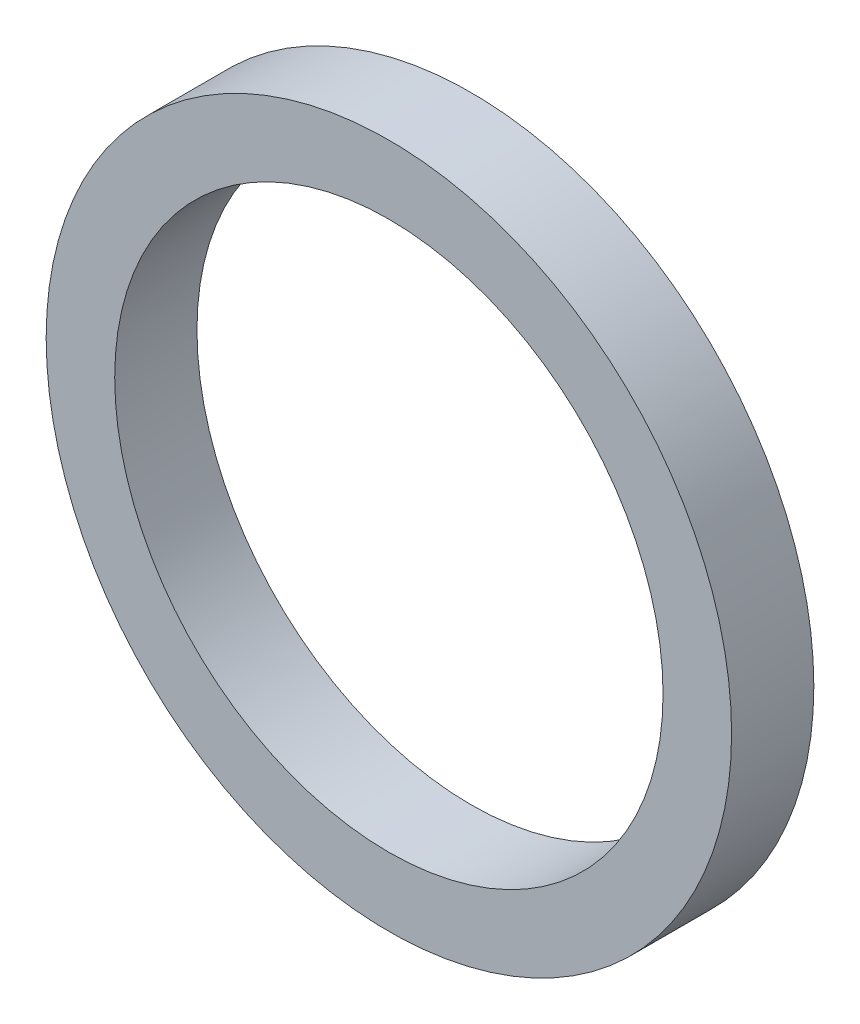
from build123d import *

# Parameters (mm, degrees)
SKETCH_1_R      = 12.5
SKETCH_1_R_2    = 10
EXTRUDE_1_DEPTH = 3


with BuildPart() as part:
    # Sketch 1 → Extrude 1 (new body)
    with BuildSketch(Plane.XY):
        Circle(SKETCH_1_R)
        Circle(SKETCH_1_R_2, mode=Mode.SUBTRACT)
    extrude(amount=EXTRUDE_1_DEPTH)


solid = part.part
